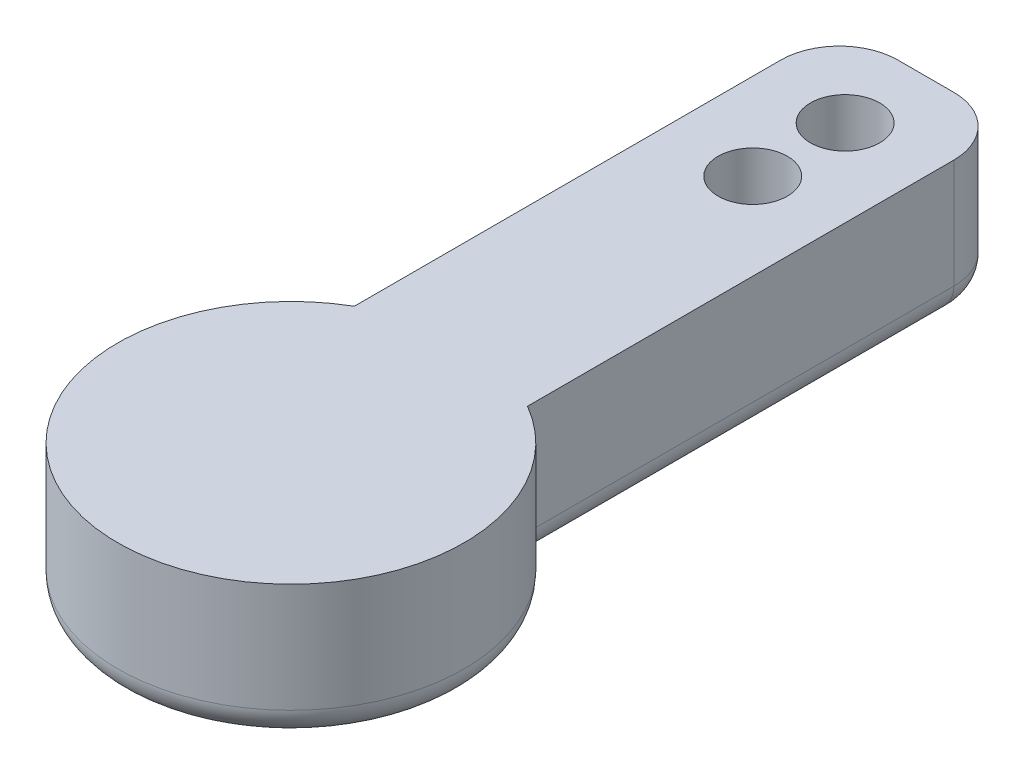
ISO-10303-21;
HEADER;
FILE_DESCRIPTION(('STEP AP214'),'2;1');
FILE_NAME('part.step','',(''),(''),'','','');
FILE_SCHEMA(('AUTOMOTIVE_DESIGN { 1 0 10303 214 1 1 1 1 }'));
ENDSEC;
DATA;
#1=APPLICATION_CONTEXT('core data for automotive mechanical design processes');
#2=APPLICATION_PROTOCOL_DEFINITION('international standard','automotive_design',2000,#1);
#3=PRODUCT_CONTEXT('',#1,'mechanical');
#4=PRODUCT('Part','Part','',(#3));
#5=PRODUCT_RELATED_PRODUCT_CATEGORY('part','',(#4));
#6=PRODUCT_DEFINITION_FORMATION('','',#4);
#7=PRODUCT_DEFINITION_CONTEXT('part definition',#1,'design');
#8=PRODUCT_DEFINITION('design','',#6,#7);
#9=PRODUCT_DEFINITION_SHAPE('','',#8);
#10=(LENGTH_UNIT() NAMED_UNIT(*) SI_UNIT(.MILLI.,.METRE.));
#11=(NAMED_UNIT(*) PLANE_ANGLE_UNIT() SI_UNIT($,.RADIAN.));
#12=(NAMED_UNIT(*) SI_UNIT($,.STERADIAN.) SOLID_ANGLE_UNIT());
#13=UNCERTAINTY_MEASURE_WITH_UNIT(LENGTH_MEASURE(1.E-05),#10,'distance_accuracy_value','');
#14=(GEOMETRIC_REPRESENTATION_CONTEXT(3) GLOBAL_UNCERTAINTY_ASSIGNED_CONTEXT((#13)) GLOBAL_UNIT_ASSIGNED_CONTEXT((#10,
#11,#12)) REPRESENTATION_CONTEXT('',''));
#15=CARTESIAN_POINT('',(0.,0.,0.));
#16=DIRECTION('',(0.,0.,1.));
#17=DIRECTION('',(1.,0.,0.));
#18=AXIS2_PLACEMENT_3D('',#15,#16,#17);
#19=CARTESIAN_POINT('',(0.,6.,0.));
#20=DIRECTION('',(0.,-1.,0.));
#21=DIRECTION('',(0.,0.,-1.));
#22=AXIS2_PLACEMENT_3D('',#19,#20,#21);
#23=CYLINDRICAL_SURFACE('',#22,3.);
#24=CARTESIAN_POINT('',(0.,0.,0.));
#25=DIRECTION('',(0.,-1.,0.));
#26=DIRECTION('',(0.,0.,-1.));
#27=AXIS2_PLACEMENT_3D('',#24,#25,#26);
#28=CIRCLE('',#27,3.);
#29=CARTESIAN_POINT('',(0.,0.,-3.));
#30=VERTEX_POINT('',#29);
#31=EDGE_CURVE('E323',#30,#30,#28,.T.);
#32=ORIENTED_EDGE('',*,*,#31,.T.);
#33=EDGE_LOOP('',(#32));
#34=FACE_BOUND('',#33,.T.);
#35=CARTESIAN_POINT('',(0.,5.,0.));
#36=DIRECTION('',(0.,1.,0.));
#37=DIRECTION('',(0.,0.,1.));
#38=AXIS2_PLACEMENT_3D('',#35,#36,#37);
#39=CIRCLE('',#38,3.);
#40=CARTESIAN_POINT('',(0.,5.,3.));
#41=VERTEX_POINT('',#40);
#42=EDGE_CURVE('E142',#41,#41,#39,.F.);
#43=ORIENTED_EDGE('',*,*,#42,.F.);
#44=EDGE_LOOP('',(#43));
#45=FACE_BOUND('',#44,.T.);
#46=ADVANCED_FACE('F46',(#34,#45),#23,.F.);
#47=CARTESIAN_POINT('',(3.75,6.,0.));
#48=DIRECTION('',(1.,0.,0.));
#49=DIRECTION('',(0.,0.,-1.));
#50=AXIS2_PLACEMENT_3D('',#47,#48,#49);
#51=PLANE('',#50);
#52=DIRECTION('',(0.,-1.,0.));
#53=VECTOR('',#52,1.);
#54=CARTESIAN_POINT('',(3.75,6.,-6.49519052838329));
#55=LINE('',#54,#53);
#56=CARTESIAN_POINT('',(3.75,6.,-6.49519052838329));
#57=VERTEX_POINT('',#56);
#58=CARTESIAN_POINT('',(3.75,1.27,-6.49519052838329));
#59=VERTEX_POINT('',#58);
#60=EDGE_CURVE('E143',#57,#59,#55,.T.);
#61=ORIENTED_EDGE('',*,*,#60,.T.);
#62=DIRECTION('',(0.,0.,1.));
#63=VECTOR('',#62,1.);
#64=CARTESIAN_POINT('',(3.74999999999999,1.27,-24.96));
#65=LINE('',#64,#63);
#66=CARTESIAN_POINT('',(3.74999999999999,1.27,-24.96));
#67=VERTEX_POINT('',#66);
#68=EDGE_CURVE('E62',#59,#67,#65,.F.);
#69=ORIENTED_EDGE('',*,*,#68,.T.);
#70=DIRECTION('',(0.,-1.,0.));
#71=VECTOR('',#70,1.);
#72=CARTESIAN_POINT('',(3.74999999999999,6.,-24.96));
#73=LINE('',#72,#71);
#74=CARTESIAN_POINT('',(3.74999999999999,6.,-24.96));
#75=VERTEX_POINT('',#74);
#76=EDGE_CURVE('E170',#67,#75,#73,.F.);
#77=ORIENTED_EDGE('',*,*,#76,.T.);
#78=DIRECTION('',(0.,0.,1.));
#79=VECTOR('',#78,1.);
#80=CARTESIAN_POINT('',(3.75,6.,0.));
#81=LINE('',#80,#79);
#82=EDGE_CURVE('E321',#75,#57,#81,.T.);
#83=ORIENTED_EDGE('',*,*,#82,.T.);
#84=EDGE_LOOP('',(#61,#69,#77,#83));
#85=FACE_BOUND('',#84,.T.);
#86=ADVANCED_FACE('F243',(#85),#51,.T.);
#87=CARTESIAN_POINT('',(0.,6.,-27.5));
#88=DIRECTION('',(0.,0.,-1.));
#89=DIRECTION('',(-1.,0.,0.));
#90=AXIS2_PLACEMENT_3D('',#87,#88,#89);
#91=PLANE('',#90);
#92=DIRECTION('',(0.,-1.,0.));
#93=VECTOR('',#92,1.);
#94=CARTESIAN_POINT('',(1.20999999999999,6.,-27.5));
#95=LINE('',#94,#93);
#96=CARTESIAN_POINT('',(1.20999999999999,6.,-27.5));
#97=VERTEX_POINT('',#96);
#98=CARTESIAN_POINT('',(1.20999999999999,1.27,-27.5));
#99=VERTEX_POINT('',#98);
#100=EDGE_CURVE('E158',#97,#99,#95,.T.);
#101=ORIENTED_EDGE('',*,*,#100,.T.);
#102=DIRECTION('',(1.,0.,0.));
#103=VECTOR('',#102,1.);
#104=CARTESIAN_POINT('',(-1.21000000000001,1.27,-27.5));
#105=LINE('',#104,#103);
#106=CARTESIAN_POINT('',(-1.21000000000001,1.27,-27.5));
#107=VERTEX_POINT('',#106);
#108=EDGE_CURVE('E196',#99,#107,#105,.F.);
#109=ORIENTED_EDGE('',*,*,#108,.T.);
#110=DIRECTION('',(0.,-1.,0.));
#111=VECTOR('',#110,1.);
#112=CARTESIAN_POINT('',(-1.21000000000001,6.,-27.5));
#113=LINE('',#112,#111);
#114=CARTESIAN_POINT('',(-1.21000000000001,6.,-27.5));
#115=VERTEX_POINT('',#114);
#116=EDGE_CURVE('E162',#107,#115,#113,.F.);
#117=ORIENTED_EDGE('',*,*,#116,.T.);
#118=DIRECTION('',(1.,0.,0.));
#119=VECTOR('',#118,1.);
#120=CARTESIAN_POINT('',(0.,6.,-27.5));
#121=LINE('',#120,#119);
#122=EDGE_CURVE('E137',#115,#97,#121,.T.);
#123=ORIENTED_EDGE('',*,*,#122,.T.);
#124=EDGE_LOOP('',(#101,#109,#117,#123));
#125=FACE_BOUND('',#124,.T.);
#126=ADVANCED_FACE('F250',(#125),#91,.T.);
#127=CARTESIAN_POINT('',(-3.75,6.,0.));
#128=DIRECTION('',(1.,0.,0.));
#129=DIRECTION('',(0.,0.,-1.));
#130=AXIS2_PLACEMENT_3D('',#127,#128,#129);
#131=PLANE('',#130);
#132=DIRECTION('',(0.,-1.,0.));
#133=VECTOR('',#132,1.);
#134=CARTESIAN_POINT('',(-3.75,0.,-24.96));
#135=LINE('',#134,#133);
#136=CARTESIAN_POINT('',(-3.75,6.,-24.96));
#137=VERTEX_POINT('',#136);
#138=CARTESIAN_POINT('',(-3.75,1.27,-24.96));
#139=VERTEX_POINT('',#138);
#140=EDGE_CURVE('E155',#137,#139,#135,.T.);
#141=ORIENTED_EDGE('',*,*,#140,.T.);
#142=DIRECTION('',(0.,0.,1.));
#143=VECTOR('',#142,1.);
#144=CARTESIAN_POINT('',(-3.75,1.27,0.));
#145=LINE('',#144,#143);
#146=CARTESIAN_POINT('',(-3.75,1.27,-6.49519052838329));
#147=VERTEX_POINT('',#146);
#148=EDGE_CURVE('E76',#139,#147,#145,.T.);
#149=ORIENTED_EDGE('',*,*,#148,.T.);
#150=DIRECTION('',(0.,-1.,0.));
#151=VECTOR('',#150,1.);
#152=CARTESIAN_POINT('',(-3.75,6.,-6.49519052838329));
#153=LINE('',#152,#151);
#154=CARTESIAN_POINT('',(-3.75,6.,-6.49519052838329));
#155=VERTEX_POINT('',#154);
#156=EDGE_CURVE('E139',#155,#147,#153,.T.);
#157=ORIENTED_EDGE('',*,*,#156,.F.);
#158=DIRECTION('',(0.,0.,1.));
#159=VECTOR('',#158,1.);
#160=CARTESIAN_POINT('',(-3.75,6.,0.));
#161=LINE('',#160,#159);
#162=EDGE_CURVE('E127',#137,#155,#161,.T.);
#163=ORIENTED_EDGE('',*,*,#162,.F.);
#164=EDGE_LOOP('',(#141,#149,#157,#163));
#165=FACE_BOUND('',#164,.T.);
#166=ADVANCED_FACE('F140',(#165),#131,.F.);
#167=CARTESIAN_POINT('',(0.,6.,0.));
#168=DIRECTION('',(0.,-1.,0.));
#169=DIRECTION('',(0.,0.,-1.));
#170=AXIS2_PLACEMENT_3D('',#167,#168,#169);
#171=CYLINDRICAL_SURFACE('',#170,7.5);
#172=ORIENTED_EDGE('',*,*,#156,.T.);
#173=CARTESIAN_POINT('',(0.,1.27,0.));
#174=DIRECTION('',(0.,1.,0.));
#175=DIRECTION('',(0.,0.,1.));
#176=AXIS2_PLACEMENT_3D('',#173,#174,#175);
#177=CIRCLE('',#176,7.5);
#178=EDGE_CURVE('E11',#147,#59,#177,.T.);
#179=ORIENTED_EDGE('',*,*,#178,.T.);
#180=ORIENTED_EDGE('',*,*,#60,.F.);
#181=CARTESIAN_POINT('',(0.,6.,0.));
#182=DIRECTION('',(0.,1.,0.));
#183=DIRECTION('',(0.,0.,1.));
#184=AXIS2_PLACEMENT_3D('',#181,#182,#183);
#185=CIRCLE('',#184,7.5);
#186=EDGE_CURVE('E132',#155,#57,#185,.T.);
#187=ORIENTED_EDGE('',*,*,#186,.F.);
#188=EDGE_LOOP('',(#172,#179,#180,#187));
#189=FACE_BOUND('',#188,.T.);
#190=ADVANCED_FACE('F145',(#189),#171,.T.);
#191=CARTESIAN_POINT('',(0.,6.,0.));
#192=DIRECTION('',(0.,1.,0.));
#193=DIRECTION('',(0.,0.,1.));
#194=AXIS2_PLACEMENT_3D('',#191,#192,#193);
#195=PLANE('',#194);
#196=CARTESIAN_POINT('',(0.,6.,-20.));
#197=DIRECTION('',(0.,-1.,0.));
#198=DIRECTION('',(0.,0.,-1.));
#199=AXIS2_PLACEMENT_3D('',#196,#197,#198);
#200=CIRCLE('',#199,1.5);
#201=CARTESIAN_POINT('',(0.,6.,-21.5));
#202=VERTEX_POINT('',#201);
#203=EDGE_CURVE('E333',#202,#202,#200,.T.);
#204=ORIENTED_EDGE('',*,*,#203,.T.);
#205=EDGE_LOOP('',(#204));
#206=FACE_BOUND('',#205,.T.);
#207=CARTESIAN_POINT('',(0.,6.,-24.));
#208=DIRECTION('',(0.,-1.,0.));
#209=DIRECTION('',(0.,0.,-1.));
#210=AXIS2_PLACEMENT_3D('',#207,#208,#209);
#211=CIRCLE('',#210,1.5);
#212=CARTESIAN_POINT('',(0.,6.,-25.5));
#213=VERTEX_POINT('',#212);
#214=EDGE_CURVE('E310',#213,#213,#211,.T.);
#215=ORIENTED_EDGE('',*,*,#214,.T.);
#216=EDGE_LOOP('',(#215));
#217=FACE_BOUND('',#216,.T.);
#218=ORIENTED_EDGE('',*,*,#122,.F.);
#219=CARTESIAN_POINT('',(-1.21000000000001,6.,-24.96));
#220=DIRECTION('',(0.,1.,0.));
#221=DIRECTION('',(0.,0.,1.));
#222=AXIS2_PLACEMENT_3D('',#219,#220,#221);
#223=CIRCLE('',#222,2.54);
#224=EDGE_CURVE('E134',#115,#137,#223,.T.);
#225=ORIENTED_EDGE('',*,*,#224,.T.);
#226=ORIENTED_EDGE('',*,*,#162,.T.);
#227=ORIENTED_EDGE('',*,*,#186,.T.);
#228=ORIENTED_EDGE('',*,*,#82,.F.);
#229=CARTESIAN_POINT('',(1.20999999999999,6.,-24.96));
#230=DIRECTION('',(0.,1.,0.));
#231=DIRECTION('',(0.,0.,1.));
#232=AXIS2_PLACEMENT_3D('',#229,#230,#231);
#233=CIRCLE('',#232,2.54);
#234=EDGE_CURVE('E165',#75,#97,#233,.T.);
#235=ORIENTED_EDGE('',*,*,#234,.T.);
#236=EDGE_LOOP('',(#218,#225,#226,#227,#228,#235));
#237=FACE_BOUND('',#236,.T.);
#238=ADVANCED_FACE('F129',(#206,#217,#237),#195,.T.);
#239=CARTESIAN_POINT('',(0.,0.,0.));
#240=DIRECTION('',(0.,1.,0.));
#241=DIRECTION('',(0.,0.,1.));
#242=AXIS2_PLACEMENT_3D('',#239,#240,#241);
#243=PLANE('',#242);
#244=DIRECTION('',(0.,0.,1.));
#245=VECTOR('',#244,1.);
#246=CARTESIAN_POINT('',(-2.48,0.,0.));
#247=LINE('',#246,#245);
#248=CARTESIAN_POINT('',(-2.48,0.,-5.71511154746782));
#249=VERTEX_POINT('',#248);
#250=CARTESIAN_POINT('',(-2.48000000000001,0.,-24.96));
#251=VERTEX_POINT('',#250);
#252=EDGE_CURVE('E179',#249,#251,#247,.F.);
#253=ORIENTED_EDGE('',*,*,#252,.T.);
#254=CARTESIAN_POINT('',(-1.21000000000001,0.,-24.96));
#255=DIRECTION('',(0.,1.,0.));
#256=DIRECTION('',(0.,0.,1.));
#257=AXIS2_PLACEMENT_3D('',#254,#255,#256);
#258=CIRCLE('',#257,1.27);
#259=CARTESIAN_POINT('',(-1.21000000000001,0.,-26.23));
#260=VERTEX_POINT('',#259);
#261=EDGE_CURVE('E188',#251,#260,#258,.F.);
#262=ORIENTED_EDGE('',*,*,#261,.T.);
#263=DIRECTION('',(1.,0.,0.));
#264=VECTOR('',#263,1.);
#265=CARTESIAN_POINT('',(1.20999999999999,0.,-26.23));
#266=LINE('',#265,#264);
#267=CARTESIAN_POINT('',(1.20999999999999,0.,-26.23));
#268=VERTEX_POINT('',#267);
#269=EDGE_CURVE('E185',#260,#268,#266,.T.);
#270=ORIENTED_EDGE('',*,*,#269,.T.);
#271=CARTESIAN_POINT('',(1.20999999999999,0.,-24.96));
#272=DIRECTION('',(0.,1.,0.));
#273=DIRECTION('',(0.,0.,1.));
#274=AXIS2_PLACEMENT_3D('',#271,#272,#273);
#275=CIRCLE('',#274,1.27);
#276=CARTESIAN_POINT('',(2.47999999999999,0.,-24.96));
#277=VERTEX_POINT('',#276);
#278=EDGE_CURVE('E182',#268,#277,#275,.F.);
#279=ORIENTED_EDGE('',*,*,#278,.T.);
#280=DIRECTION('',(0.,0.,1.));
#281=VECTOR('',#280,1.);
#282=CARTESIAN_POINT('',(2.48,0.,-6.49519052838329));
#283=LINE('',#282,#281);
#284=CARTESIAN_POINT('',(2.48,0.,-5.71511154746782));
#285=VERTEX_POINT('',#284);
#286=EDGE_CURVE('E176',#277,#285,#283,.T.);
#287=ORIENTED_EDGE('',*,*,#286,.T.);
#288=CARTESIAN_POINT('',(0.,0.,0.));
#289=DIRECTION('',(0.,1.,0.));
#290=DIRECTION('',(0.,0.,1.));
#291=AXIS2_PLACEMENT_3D('',#288,#289,#290);
#292=CIRCLE('',#291,6.23);
#293=EDGE_CURVE('E173',#285,#249,#292,.F.);
#294=ORIENTED_EDGE('',*,*,#293,.T.);
#295=EDGE_LOOP('',(#253,#262,#270,#279,#287,#294));
#296=FACE_BOUND('',#295,.T.);
#297=ORIENTED_EDGE('',*,*,#31,.F.);
#298=EDGE_LOOP('',(#297));
#299=FACE_BOUND('',#298,.T.);
#300=CARTESIAN_POINT('',(0.,0.,-20.));
#301=DIRECTION('',(0.,-1.,0.));
#302=DIRECTION('',(0.,0.,-1.));
#303=AXIS2_PLACEMENT_3D('',#300,#301,#302);
#304=CIRCLE('',#303,1.5);
#305=CARTESIAN_POINT('',(0.,0.,-21.5));
#306=VERTEX_POINT('',#305);
#307=EDGE_CURVE('E337',#306,#306,#304,.T.);
#308=ORIENTED_EDGE('',*,*,#307,.F.);
#309=EDGE_LOOP('',(#308));
#310=FACE_BOUND('',#309,.T.);
#311=CARTESIAN_POINT('',(0.,0.,-24.));
#312=DIRECTION('',(0.,-1.,0.));
#313=DIRECTION('',(0.,0.,-1.));
#314=AXIS2_PLACEMENT_3D('',#311,#312,#313);
#315=CIRCLE('',#314,1.5);
#316=CARTESIAN_POINT('',(0.,0.,-25.5));
#317=VERTEX_POINT('',#316);
#318=EDGE_CURVE('E329',#317,#317,#315,.T.);
#319=ORIENTED_EDGE('',*,*,#318,.F.);
#320=EDGE_LOOP('',(#319));
#321=FACE_BOUND('',#320,.T.);
#322=ADVANCED_FACE('F265',(#296,#299,#310,#321),#243,.F.);
#323=CARTESIAN_POINT('',(0.,6.,-24.));
#324=DIRECTION('',(0.,-1.,0.));
#325=DIRECTION('',(0.,0.,-1.));
#326=AXIS2_PLACEMENT_3D('',#323,#324,#325);
#327=CYLINDRICAL_SURFACE('',#326,1.5);
#328=ORIENTED_EDGE('',*,*,#214,.F.);
#329=EDGE_LOOP('',(#328));
#330=FACE_BOUND('',#329,.T.);
#331=ORIENTED_EDGE('',*,*,#318,.T.);
#332=EDGE_LOOP('',(#331));
#333=FACE_BOUND('',#332,.T.);
#334=ADVANCED_FACE('F261',(#330,#333),#327,.F.);
#335=CARTESIAN_POINT('',(0.,6.,-20.));
#336=DIRECTION('',(0.,-1.,0.));
#337=DIRECTION('',(0.,0.,-1.));
#338=AXIS2_PLACEMENT_3D('',#335,#336,#337);
#339=CYLINDRICAL_SURFACE('',#338,1.5);
#340=ORIENTED_EDGE('',*,*,#203,.F.);
#341=EDGE_LOOP('',(#340));
#342=FACE_BOUND('',#341,.T.);
#343=ORIENTED_EDGE('',*,*,#307,.T.);
#344=EDGE_LOOP('',(#343));
#345=FACE_BOUND('',#344,.T.);
#346=ADVANCED_FACE('F258',(#342,#345),#339,.F.);
#347=CARTESIAN_POINT('',(0.,5.,0.));
#348=DIRECTION('',(0.,1.,0.));
#349=DIRECTION('',(0.,0.,1.));
#350=AXIS2_PLACEMENT_3D('',#347,#348,#349);
#351=PLANE('',#350);
#352=ORIENTED_EDGE('',*,*,#42,.T.);
#353=EDGE_LOOP('',(#352));
#354=FACE_BOUND('',#353,.T.);
#355=ADVANCED_FACE('F257',(#354),#351,.F.);
#356=CARTESIAN_POINT('',(-1.21000000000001,6.,-24.96));
#357=DIRECTION('',(0.,1.,0.));
#358=DIRECTION('',(0.,0.,1.));
#359=AXIS2_PLACEMENT_3D('',#356,#357,#358);
#360=CYLINDRICAL_SURFACE('',#359,2.54);
#361=ORIENTED_EDGE('',*,*,#116,.F.);
#362=CARTESIAN_POINT('',(-1.21000000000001,1.27,-24.96));
#363=DIRECTION('',(0.,1.,0.));
#364=DIRECTION('',(0.,0.,1.));
#365=AXIS2_PLACEMENT_3D('',#362,#363,#364);
#366=CIRCLE('',#365,2.54);
#367=EDGE_CURVE('E192',#107,#139,#366,.T.);
#368=ORIENTED_EDGE('',*,*,#367,.T.);
#369=ORIENTED_EDGE('',*,*,#140,.F.);
#370=ORIENTED_EDGE('',*,*,#224,.F.);
#371=EDGE_LOOP('',(#361,#368,#369,#370));
#372=FACE_BOUND('',#371,.T.);
#373=ADVANCED_FACE('F280',(#372),#360,.T.);
#374=CARTESIAN_POINT('',(1.20999999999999,6.,-24.96));
#375=DIRECTION('',(0.,-1.,0.));
#376=DIRECTION('',(0.,0.,-1.));
#377=AXIS2_PLACEMENT_3D('',#374,#375,#376);
#378=CYLINDRICAL_SURFACE('',#377,2.54);
#379=ORIENTED_EDGE('',*,*,#76,.F.);
#380=CARTESIAN_POINT('',(1.20999999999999,1.27,-24.96));
#381=DIRECTION('',(0.,1.,0.));
#382=DIRECTION('',(0.,0.,1.));
#383=AXIS2_PLACEMENT_3D('',#380,#381,#382);
#384=CIRCLE('',#383,2.54);
#385=EDGE_CURVE('E199',#67,#99,#384,.T.);
#386=ORIENTED_EDGE('',*,*,#385,.T.);
#387=ORIENTED_EDGE('',*,*,#100,.F.);
#388=ORIENTED_EDGE('',*,*,#234,.F.);
#389=EDGE_LOOP('',(#379,#386,#387,#388));
#390=FACE_BOUND('',#389,.T.);
#391=ADVANCED_FACE('F283',(#390),#378,.T.);
#392=CARTESIAN_POINT('',(2.48,1.27,0.));
#393=DIRECTION('',(0.,0.,-1.));
#394=DIRECTION('',(-1.,0.,0.));
#395=AXIS2_PLACEMENT_3D('',#392,#393,#394);
#396=CYLINDRICAL_SURFACE('',#395,1.27);
#397=CARTESIAN_POINT('',(2.47999999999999,1.27,-24.96));
#398=DIRECTION('',(0.,0.,-1.));
#399=DIRECTION('',(-1.,0.,0.));
#400=AXIS2_PLACEMENT_3D('',#397,#398,#399);
#401=CIRCLE('',#400,1.27);
#402=EDGE_CURVE('E224',#67,#277,#401,.T.);
#403=ORIENTED_EDGE('',*,*,#402,.F.);
#404=ORIENTED_EDGE('',*,*,#68,.F.);
#405=CARTESIAN_POINT('',(3.75,1.27,-6.49519052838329));
#406=CARTESIAN_POINT('',(3.75000190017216,1.23778105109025,-6.49519124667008));
#407=CARTESIAN_POINT('',(3.74877300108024,1.20557885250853,-6.49448215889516));
#408=CARTESIAN_POINT('',(3.74388467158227,1.14143121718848,-6.49165911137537));
#409=CARTESIAN_POINT('',(3.74022598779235,1.10948570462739,-6.48954558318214));
#410=CARTESIAN_POINT('',(3.72569839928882,1.01465059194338,-6.48114735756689));
#411=CARTESIAN_POINT('',(3.71127725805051,0.952441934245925,-6.47280467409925));
#412=CARTESIAN_POINT('',(3.67368055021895,0.831793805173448,-6.45098606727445));
#413=CARTESIAN_POINT('',(3.65051153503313,0.773351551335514,-6.43751398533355));
#414=CARTESIAN_POINT('',(3.5964498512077,0.661475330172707,-6.40594430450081));
#415=CARTESIAN_POINT('',(3.56555138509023,0.608045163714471,-6.38784323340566));
#416=CARTESIAN_POINT('',(3.49560542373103,0.504807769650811,-6.34665137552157));
#417=CARTESIAN_POINT('',(3.4562378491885,0.455297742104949,-6.32336271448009));
#418=CARTESIAN_POINT('',(3.37177951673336,0.363623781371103,-6.2730756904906));
#419=CARTESIAN_POINT('',(3.32668744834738,0.321461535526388,-6.24607647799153));
#420=CARTESIAN_POINT('',(3.22616200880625,0.240031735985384,-6.18544612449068));
#421=CARTESIAN_POINT('',(3.17014119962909,0.201794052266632,-6.1514079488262));
#422=CARTESIAN_POINT('',(3.05420186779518,0.135245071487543,-6.08031907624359));
#423=CARTESIAN_POINT('',(2.99427895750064,0.106945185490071,-6.04326497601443));
#424=CARTESIAN_POINT('',(2.8605806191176,0.0558763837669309,-5.95977396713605));
#425=CARTESIAN_POINT('',(2.78631502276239,0.0351404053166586,-5.91288073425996));
#426=CARTESIAN_POINT('',(2.63664255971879,0.00740683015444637,-5.81718165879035));
#427=CARTESIAN_POINT('',(2.56123815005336,0.000383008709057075,-5.76837964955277));
#428=CARTESIAN_POINT('',(2.48414798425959,5.07366473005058E-06,-5.71783278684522));
#429=CARTESIAN_POINT('',(2.48207383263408,-6.33269664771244E-09,-5.71647230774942));
#430=CARTESIAN_POINT('',(2.48,0.,-5.71511154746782));
#431=B_SPLINE_CURVE_WITH_KNOTS('',3,(#405,#406,#407,#408,#409,#410,#411,#412,#413,#414,#415,
#416,#417,#418,#419,#420,#421,#422,#423,#424,#425,#426,#427,#428,#429,#430),.UNSPECIFIED.,.F.,
.F.,(4,2,2,2,2,2,2,2,2,2,2,2,4),(0.,0.0965929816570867,0.193156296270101,0.385334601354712,
0.577369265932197,0.769548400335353,0.970956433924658,1.17241065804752,1.39918503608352,
1.62621896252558,1.89583528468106,2.16493545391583,2.17237702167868),.UNSPECIFIED.);
#432=EDGE_CURVE('E51',#285,#59,#431,.F.);
#433=ORIENTED_EDGE('',*,*,#432,.F.);
#434=ORIENTED_EDGE('',*,*,#286,.F.);
#435=EDGE_LOOP('',(#403,#404,#433,#434));
#436=FACE_BOUND('',#435,.T.);
#437=ADVANCED_FACE('F48',(#436),#396,.T.);
#438=CARTESIAN_POINT('',(0.,1.27,0.));
#439=DIRECTION('',(0.,1.,0.));
#440=DIRECTION('',(0.,0.,1.));
#441=AXIS2_PLACEMENT_3D('',#438,#439,#440);
#442=TOROIDAL_SURFACE('',#441,6.23,1.27);
#443=ORIENTED_EDGE('',*,*,#432,.T.);
#444=ORIENTED_EDGE('',*,*,#178,.F.);
#445=CARTESIAN_POINT('',(-3.75,1.27,-6.49519052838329));
#446=CARTESIAN_POINT('',(-3.75000190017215,1.23778105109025,-6.49519124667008));
#447=CARTESIAN_POINT('',(-3.74877300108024,1.20557885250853,-6.49448215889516));
#448=CARTESIAN_POINT('',(-3.74388467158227,1.14143121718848,-6.49165911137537));
#449=CARTESIAN_POINT('',(-3.74022598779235,1.10948570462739,-6.48954558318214));
#450=CARTESIAN_POINT('',(-3.72569839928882,1.01465059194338,-6.48114735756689));
#451=CARTESIAN_POINT('',(-3.71127725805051,0.952441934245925,-6.47280467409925));
#452=CARTESIAN_POINT('',(-3.67368055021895,0.831793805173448,-6.45098606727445));
#453=CARTESIAN_POINT('',(-3.65051153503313,0.773351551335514,-6.43751398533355));
#454=CARTESIAN_POINT('',(-3.5964498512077,0.661475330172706,-6.40594430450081));
#455=CARTESIAN_POINT('',(-3.56555138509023,0.608045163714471,-6.38784323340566));
#456=CARTESIAN_POINT('',(-3.49560542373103,0.504807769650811,-6.34665137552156));
#457=CARTESIAN_POINT('',(-3.4562378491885,0.455297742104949,-6.32336271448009));
#458=CARTESIAN_POINT('',(-3.37177951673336,0.363623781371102,-6.2730756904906));
#459=CARTESIAN_POINT('',(-3.32668744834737,0.321461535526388,-6.24607647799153));
#460=CARTESIAN_POINT('',(-3.22616200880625,0.240031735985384,-6.18544612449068));
#461=CARTESIAN_POINT('',(-3.17014119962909,0.201794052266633,-6.1514079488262));
#462=CARTESIAN_POINT('',(-3.05420186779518,0.135245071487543,-6.0803190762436));
#463=CARTESIAN_POINT('',(-2.99427895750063,0.106945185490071,-6.04326497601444));
#464=CARTESIAN_POINT('',(-2.86058061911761,0.0558763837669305,-5.95977396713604));
#465=CARTESIAN_POINT('',(-2.78631502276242,0.0351404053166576,-5.91288073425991));
#466=CARTESIAN_POINT('',(-2.63664255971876,0.00740683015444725,-5.8171816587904));
#467=CARTESIAN_POINT('',(-2.56123815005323,0.000383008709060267,-5.76837964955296));
#468=CARTESIAN_POINT('',(-2.48414798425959,5.07366473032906E-06,-5.71783278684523));
#469=CARTESIAN_POINT('',(-2.48207383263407,-6.33269645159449E-09,-5.71647230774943));
#470=CARTESIAN_POINT('',(-2.48,0.,-5.71511154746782));
#471=B_SPLINE_CURVE_WITH_KNOTS('',3,(#445,#446,#447,#448,#449,#450,#451,#452,#453,#454,#455,
#456,#457,#458,#459,#460,#461,#462,#463,#464,#465,#466,#467,#468,#469,#470),.UNSPECIFIED.,.F.,
.F.,(4,2,2,2,2,2,2,2,2,2,2,2,4),(0.,0.0965929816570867,0.193156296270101,0.385334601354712,
0.577369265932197,0.769548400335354,0.970956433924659,1.17241065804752,1.39918503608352,
1.62621896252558,1.89583528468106,2.16493545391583,2.17237702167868),.UNSPECIFIED.);
#472=EDGE_CURVE('E216',#249,#147,#471,.F.);
#473=ORIENTED_EDGE('',*,*,#472,.F.);
#474=ORIENTED_EDGE('',*,*,#293,.F.);
#475=EDGE_LOOP('',(#443,#444,#473,#474));
#476=FACE_BOUND('',#475,.T.);
#477=ADVANCED_FACE('F228',(#476),#442,.T.);
#478=CARTESIAN_POINT('',(1.20999999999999,1.27,-24.96));
#479=DIRECTION('',(0.,1.,0.));
#480=DIRECTION('',(0.,0.,1.));
#481=AXIS2_PLACEMENT_3D('',#478,#479,#480);
#482=DEGENERATE_TOROIDAL_SURFACE('',#481,1.27,1.27,.T.);
#483=ORIENTED_EDGE('',*,*,#402,.T.);
#484=ORIENTED_EDGE('',*,*,#278,.F.);
#485=CARTESIAN_POINT('',(1.20999999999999,1.27,-26.23));
#486=DIRECTION('',(-1.,0.,0.));
#487=DIRECTION('',(0.,0.,1.));
#488=AXIS2_PLACEMENT_3D('',#485,#486,#487);
#489=CIRCLE('',#488,1.27);
#490=EDGE_CURVE('E212',#99,#268,#489,.T.);
#491=ORIENTED_EDGE('',*,*,#490,.F.);
#492=ORIENTED_EDGE('',*,*,#385,.F.);
#493=EDGE_LOOP('',(#483,#484,#491,#492));
#494=FACE_BOUND('',#493,.T.);
#495=ADVANCED_FACE('F231',(#494),#482,.T.);
#496=CARTESIAN_POINT('',(-2.48,1.27,0.));
#497=DIRECTION('',(0.,0.,1.));
#498=DIRECTION('',(1.,0.,0.));
#499=AXIS2_PLACEMENT_3D('',#496,#497,#498);
#500=CYLINDRICAL_SURFACE('',#499,1.27);
#501=ORIENTED_EDGE('',*,*,#472,.T.);
#502=ORIENTED_EDGE('',*,*,#148,.F.);
#503=CARTESIAN_POINT('',(-2.48000000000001,1.27,-24.96));
#504=DIRECTION('',(0.,0.,-1.));
#505=DIRECTION('',(-1.,0.,0.));
#506=AXIS2_PLACEMENT_3D('',#503,#504,#505);
#507=CIRCLE('',#506,1.27);
#508=EDGE_CURVE('E209',#251,#139,#507,.T.);
#509=ORIENTED_EDGE('',*,*,#508,.F.);
#510=ORIENTED_EDGE('',*,*,#252,.F.);
#511=EDGE_LOOP('',(#501,#502,#509,#510));
#512=FACE_BOUND('',#511,.T.);
#513=ADVANCED_FACE('F225',(#512),#500,.T.);
#514=CARTESIAN_POINT('',(0.,1.27,-26.23));
#515=DIRECTION('',(-1.,0.,0.));
#516=DIRECTION('',(0.,0.,1.));
#517=AXIS2_PLACEMENT_3D('',#514,#515,#516);
#518=CYLINDRICAL_SURFACE('',#517,1.27);
#519=ORIENTED_EDGE('',*,*,#490,.T.);
#520=ORIENTED_EDGE('',*,*,#269,.F.);
#521=CARTESIAN_POINT('',(-1.21000000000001,1.27,-26.23));
#522=DIRECTION('',(-1.,0.,0.));
#523=DIRECTION('',(0.,0.,1.));
#524=AXIS2_PLACEMENT_3D('',#521,#522,#523);
#525=CIRCLE('',#524,1.27);
#526=EDGE_CURVE('E206',#107,#260,#525,.T.);
#527=ORIENTED_EDGE('',*,*,#526,.F.);
#528=ORIENTED_EDGE('',*,*,#108,.F.);
#529=EDGE_LOOP('',(#519,#520,#527,#528));
#530=FACE_BOUND('',#529,.T.);
#531=ADVANCED_FACE('F239',(#530),#518,.T.);
#532=CARTESIAN_POINT('',(-1.21000000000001,1.27,-24.96));
#533=DIRECTION('',(0.,1.,0.));
#534=DIRECTION('',(0.,0.,1.));
#535=AXIS2_PLACEMENT_3D('',#532,#533,#534);
#536=DEGENERATE_TOROIDAL_SURFACE('',#535,1.27,1.27,.T.);
#537=ORIENTED_EDGE('',*,*,#508,.T.);
#538=ORIENTED_EDGE('',*,*,#367,.F.);
#539=ORIENTED_EDGE('',*,*,#526,.T.);
#540=ORIENTED_EDGE('',*,*,#261,.F.);
#541=EDGE_LOOP('',(#537,#538,#539,#540));
#542=FACE_BOUND('',#541,.T.);
#543=ADVANCED_FACE('F288',(#542),#536,.T.);
#544=CLOSED_SHELL('',(#46,#86,#126,#166,#190,#238,#322,#334,#346,#355,#373,#391,#437,#477,#495,
#513,#531,#543));
#545=MANIFOLD_SOLID_BREP('B2',#544);
#546=ADVANCED_BREP_SHAPE_REPRESENTATION('',(#18,#545),#14);
#547=SHAPE_DEFINITION_REPRESENTATION(#9,#546);
ENDSEC;
END-ISO-10303-21;
